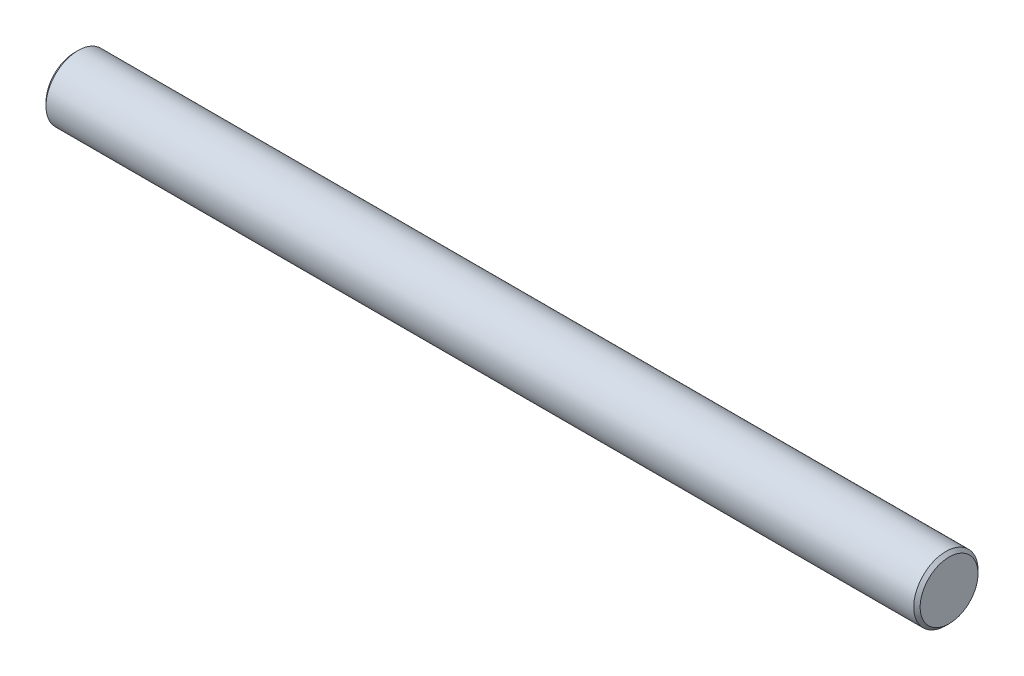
from build123d import *

# Parameters (mm, degrees)
SKETCH1_R      = 10
EXTRUDE1_DEPTH = 272
CHAMFER1_SIZE  = 1


with BuildPart() as part:
    # Sketch1 → Extrude1 (new body)
    with BuildSketch(Plane(origin=(0, 0, 0), x_dir=(0, 0, -1), z_dir=(1, 0, 0))):
        Circle(SKETCH1_R)
    extrude(amount=EXTRUDE1_DEPTH)

    # Chamfer1
    chamfer1_edges = [part.edges().sort_by_distance(p)[0] for p in [
        (0, 0, 10),
        (272, 0, 10),
    ]]
    chamfer(chamfer1_edges, length=CHAMFER1_SIZE)


solid = part.part
